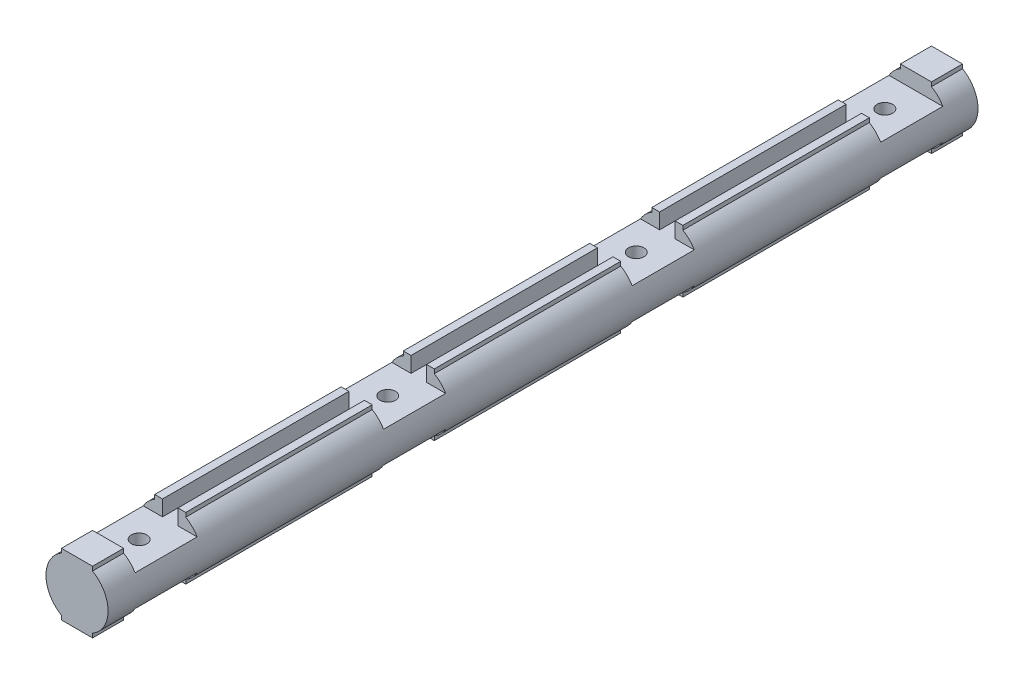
from build123d import *

# Parameters (mm, degrees)
SKETCH1_R               = 10
BOSS_EXTRUDE1_DEPTH     = 140
SKETCH2_W               = 10
SKETCH2_H               = 20
BOSS_EXTRUDE2_DEPTH     = 280
SKETCH3_W               = 17.320508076
SKETCH3_H               = 5
CUT_EXTRUDE1_DEPTH      = 10
SKETCH4_R               = 2.5
CUT_EXTRUDE3_DEPTH      = 142.155942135
SKETCH5_W               = 5
SKETCH5_H               = 220
CUT_EXTRUDE2_DEPTH      = 5
LPATTERN1_COUNT         = 4
LPATTERN1_PITCH         = 80
MIRROR3_COPY_1_SKETCH_W = 17.320508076
MIRROR3_COPY_1_SKETCH_H = 5
MIRROR3_COPY_1_DEPTH    = 10
MIRROR3_COPY_2_SKETCH_W = 17.320508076
MIRROR3_COPY_2_SKETCH_H = 5
MIRROR3_COPY_2_DEPTH    = 10
MIRROR3_COPY_3_SKETCH_W = 17.320508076
MIRROR3_COPY_3_SKETCH_H = 5
MIRROR3_COPY_3_DEPTH    = 10
MIRROR3_COPY_4_SKETCH_R = 2.5
MIRROR3_COPY_4_DEPTH    = 142.155942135
MIRROR3_COPY_5_SKETCH_R = 2.5
MIRROR3_COPY_5_DEPTH    = 142.155942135
MIRROR3_COPY_6_SKETCH_R = 2.5
MIRROR3_COPY_6_DEPTH    = 142.155942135
MIRROR3_COPY_7_SKETCH_R = 2.5
MIRROR3_COPY_7_DEPTH    = 142.155942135


with BuildPart() as part:
    # Sketch1 → Boss-Extrude1 (new, symmetric)
    with BuildSketch(Plane.XY):
        Circle(SKETCH1_R)
    extrude(amount=BOSS_EXTRUDE1_DEPTH, both=True)

    # Sketch2 → Boss-Extrude2 (add)
    with BuildSketch(Plane.XY.offset(140)):
        Rectangle(SKETCH2_W, SKETCH2_H)
    extrude(amount=-BOSS_EXTRUDE2_DEPTH)

    # Sketch3 → Cut-Extrude1 (cut, symmetric)
    with BuildSketch(Plane.XY.offset(-120)):
        with Locations((0, 7.5)):
            Rectangle(SKETCH3_W, SKETCH3_H)
    cut_extrude1 = extrude(amount=CUT_EXTRUDE1_DEPTH, both=True, mode=Mode.SUBTRACT)

    # Sketch4 → Cut-Extrude3 (cut, through all)
    with BuildSketch(Plane(origin=(0, 5, 0), x_dir=(1, 0, 0), z_dir=(0, 1, 0))):
        with Locations(Location((0, 120, 0), (0, 0, 270))):
            Circle(SKETCH4_R)
    cut_extrude3 = extrude(amount=-CUT_EXTRUDE3_DEPTH, mode=Mode.SUBTRACT)

    # Sketch5 → Cut-Extrude2 (cut)
    with BuildSketch(Plane(origin=(0, 10, 0), x_dir=(1, 0, 0), z_dir=(0, 1, 0))):
        Rectangle(SKETCH5_W, SKETCH5_H)
    cut_extrude2 = extrude(amount=-CUT_EXTRUDE2_DEPTH, mode=Mode.SUBTRACT)

    # LPattern1: Cut-Extrude1, Cut-Extrude3 ×4
    with Locations(*[(0, 0, i * LPATTERN1_PITCH) for i in range(1, LPATTERN1_COUNT)]):
        add(cut_extrude1, mode=Mode.SUBTRACT)
        add(cut_extrude3, mode=Mode.SUBTRACT)

    # Mirror3: Cut-Extrude1, Cut-Extrude2 across plane
    add(cut_extrude1.mirror(Plane.ZX), mode=Mode.SUBTRACT)
    add(cut_extrude2.mirror(Plane.ZX), mode=Mode.SUBTRACT)

    # Mirror3 copy 1 sketch → Mirror3 copy 1 (cut, symmetric)
    with BuildSketch(Plane.XY.offset(-40)):
        with Locations((0, -7.5)):
            Rectangle(MIRROR3_COPY_1_SKETCH_W, MIRROR3_COPY_1_SKETCH_H)
    extrude(amount=MIRROR3_COPY_1_DEPTH, both=True, mode=Mode.SUBTRACT)

    # Mirror3 copy 2 sketch → Mirror3 copy 2 (cut, symmetric)
    with BuildSketch(Plane.XY.offset(40)):
        with Locations((0, -7.5)):
            Rectangle(MIRROR3_COPY_2_SKETCH_W, MIRROR3_COPY_2_SKETCH_H)
    extrude(amount=MIRROR3_COPY_2_DEPTH, both=True, mode=Mode.SUBTRACT)

    # Mirror3 copy 3 sketch → Mirror3 copy 3 (cut, symmetric)
    with BuildSketch(Plane.XY.offset(120)):
        with Locations((0, -7.5)):
            Rectangle(MIRROR3_COPY_3_SKETCH_W, MIRROR3_COPY_3_SKETCH_H)
    extrude(amount=MIRROR3_COPY_3_DEPTH, both=True, mode=Mode.SUBTRACT)

    # Mirror3 copy 4 sketch → Mirror3 copy 4 (cut, through all)
    with BuildSketch(Plane(origin=(0, -5, 80), x_dir=(1, 0, 0), z_dir=(0, -1, 0))):
        with Locations((0, -120)):
            Circle(MIRROR3_COPY_4_SKETCH_R)
    extrude(amount=-MIRROR3_COPY_4_DEPTH, mode=Mode.SUBTRACT)

    # Mirror3 copy 5 sketch → Mirror3 copy 5 (cut, through all)
    with BuildSketch(Plane(origin=(0, -5, 160), x_dir=(1, 0, 0), z_dir=(0, -1, 0))):
        with Locations((0, -120)):
            Circle(MIRROR3_COPY_5_SKETCH_R)
    extrude(amount=-MIRROR3_COPY_5_DEPTH, mode=Mode.SUBTRACT)

    # Mirror3 copy 6 sketch → Mirror3 copy 6 (cut, through all)
    with BuildSketch(Plane(origin=(0, -5, 240), x_dir=(1, 0, 0), z_dir=(0, -1, 0))):
        with Locations((0, -120)):
            Circle(MIRROR3_COPY_6_SKETCH_R)
    extrude(amount=-MIRROR3_COPY_6_DEPTH, mode=Mode.SUBTRACT)

    # Mirror3 copy 7 sketch → Mirror3 copy 7 (cut, through all)
    with BuildSketch(Plane.XZ.offset(5)):
        with Locations((0, -120)):
            Circle(MIRROR3_COPY_7_SKETCH_R)
    extrude(amount=-MIRROR3_COPY_7_DEPTH, mode=Mode.SUBTRACT)


solid = part.part
